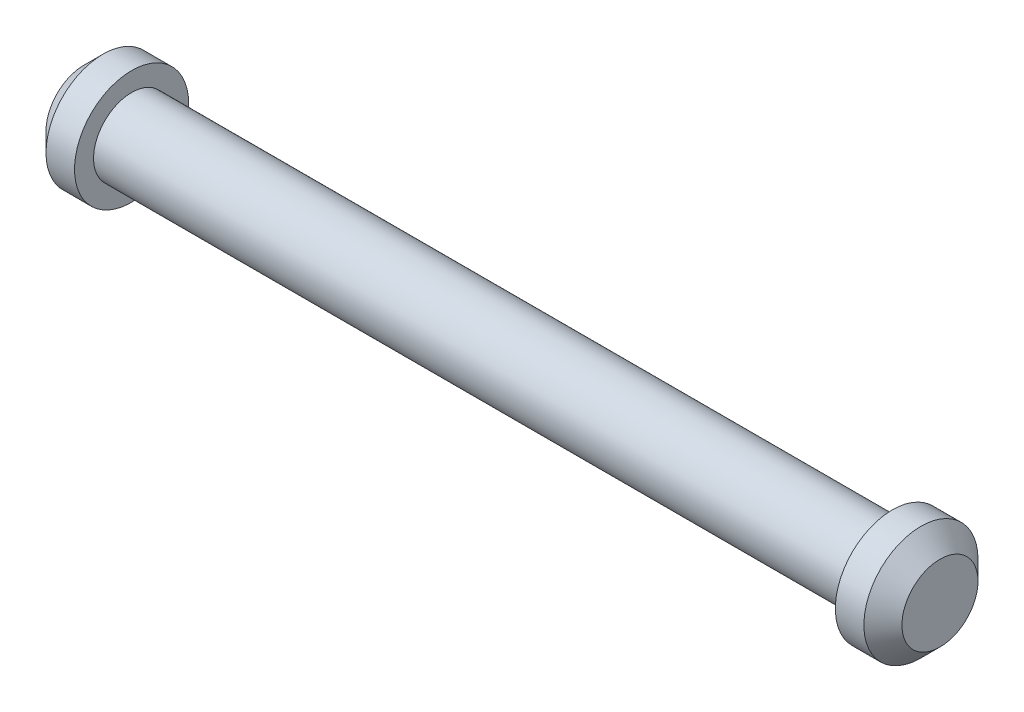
from build123d import *

# Parameters (mm, degrees)
SKETCH1_R                = 4
BOSS_EXTRUDE1_DEPTH      = 40
SKETCH2_R                = 6
BOSS_EXTRUDE2_DEPTH      = 5
CHAMFER1_SIZE            = 2
CHAMFER1_OF_MIRROR1_SIZE = 2


with BuildPart() as part:
    # Sketch1 → Boss-Extrude1 (new, symmetric)
    with BuildSketch(Plane(origin=(0, 0, 0), x_dir=(0, 0, -1), z_dir=(1, 0, 0))):
        Circle(SKETCH1_R)
    extrude(amount=BOSS_EXTRUDE1_DEPTH, both=True)

    # Sketch2 → Boss-Extrude2 (add)
    with BuildSketch(Plane(origin=(40, 0, 0), x_dir=(0, 0, -1), z_dir=(1, 0, 0))):
        Circle(SKETCH2_R)
    boss_extrude2 = extrude(amount=BOSS_EXTRUDE2_DEPTH)

    # Chamfer1
    chamfer1_edges = [part.edges().sort_by_distance(p)[0] for p in [
        (45, 0, 6),
    ]]
    chamfer(chamfer1_edges, length=CHAMFER1_SIZE)

    # Mirror1: Boss-Extrude2 across plane
    add(boss_extrude2.mirror(Plane(origin=(0, 0, 0), x_dir=(0, 0, 1), z_dir=(1, 0, 0))))

    # Chamfer1 of Mirror1
    chamfer1_of_mirror1_edges = [part.edges().sort_by_distance(p)[0] for p in [
        (-45, 0, 6),
    ]]
    chamfer(chamfer1_of_mirror1_edges, length=CHAMFER1_OF_MIRROR1_SIZE)


solid = part.part
